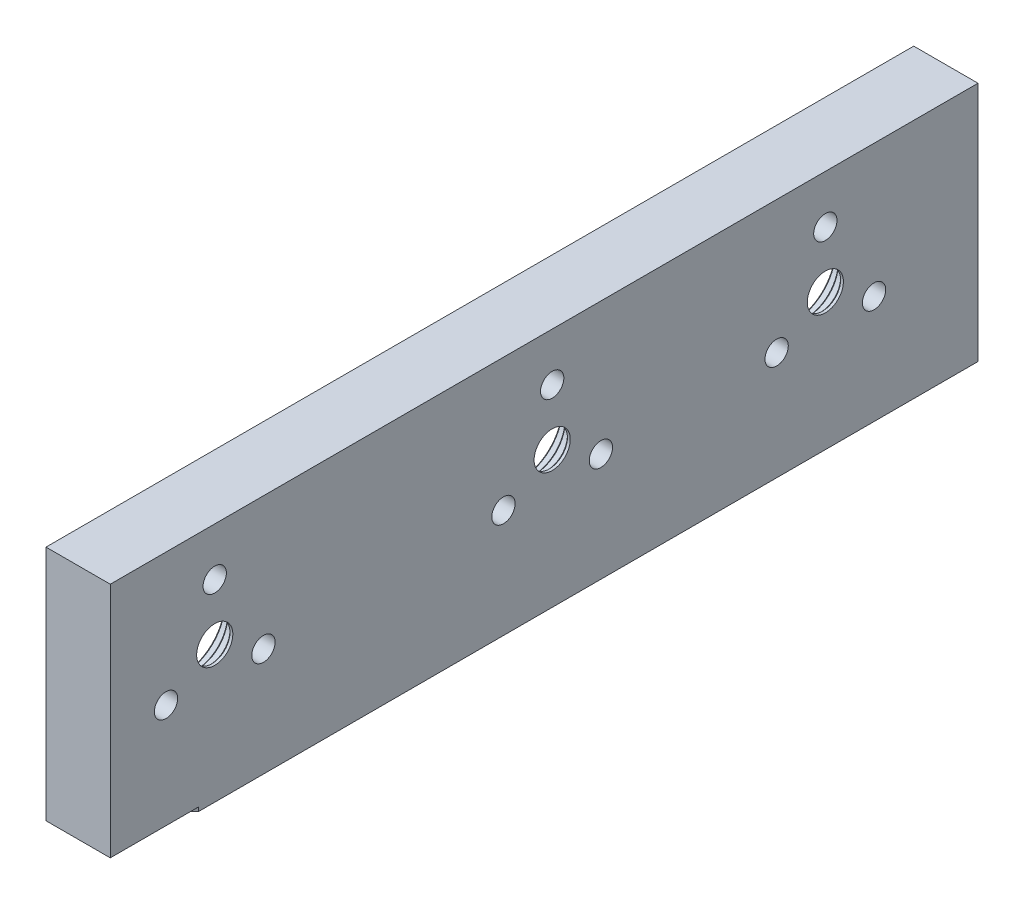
from build123d import *

# Parameters (mm, degrees)
SKETCH1_W                    = 8
SKETCH1_H                    = 108
BOSS_EXTRUDE1_DEPTH          = 30
SKETCH31_R                   = 9.5
BOSS_EXTRUDE3_DEPTH          = 1
SKETCH30_R                   = 4.1875
BOSS_EXTRUDE2_DEPTH          = 2.4666
SKETCH2_R                    = 11.25
CUT_EXTRUDE1_DEPTH           = 4
SKETCH3_R                    = 5.004
CUT_EXTRUDE2_DEPTH           = 1.6
SKETCH28_R                   = 3.75
CUT_EXTRUDE10_DEPTH          = 1.8
SKETCH29_R                   = 2.25
CUT_EXTRUDE11_DEPTH          = 64.085339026
SKETCH32_R                   = 9.5
CUT_EXTRUDE12_DEPTH          = 64.158530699
M2_5_CLEARANCE_HOLE1_D       = 2.9
LPATTERN1_COUNT              = 2
LPATTERN1_PITCH              = 34
LPATTERN1_COL_COUNT          = 2
LPATTERN1_COL_PITCH          = 42
M2_5X0_45_TAPPED_HOLE1_D     = 2.05
M2_5X0_45_TAPPED_HOLE1_DEPTH = 5
M2_5X0_45_TAPPED_HOLE1_TIP   = 0.615882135
CUT_EXTRUDE9_DEPTH           = 0.5
CHAMFER1_SIZE                = 0.25


with BuildPart() as part:
    # Sketch1 → Boss-Extrude1 (new body)
    with BuildSketch(Plane(origin=(0, 0, 0), x_dir=(1, 0, 0), z_dir=(0, 1, 0))):
        with Locations((0, -1)):
            Rectangle(SKETCH1_W, SKETCH1_H)
    extrude(amount=BOSS_EXTRUDE1_DEPTH)

    # Sketch31 → Boss-Extrude3 (add)
    with BuildSketch(Plane(origin=(4, 0, 0), x_dir=(0, 0, -1), z_dir=(1, 0, 0))):
        with Locations(Location((0, 17, 0), (0, 0, 180))):
            Circle(SKETCH31_R)
    extrude(amount=BOSS_EXTRUDE3_DEPTH)

    # Sketch30 → Boss-Extrude2 (add)
    with BuildSketch(Plane(origin=(5, 0, 0), x_dir=(0, 0, -1), z_dir=(1, 0, 0))):
        with Locations((0, 17)):
            Circle(SKETCH30_R)
    extrude(amount=BOSS_EXTRUDE2_DEPTH)

    # Sketch2 → Cut-Extrude1 (cut)
    with BuildSketch(Plane.ZY.offset(4)):
        with Locations((0, 17)):
            Circle(SKETCH2_R)
    cut_extrude1 = extrude(amount=-CUT_EXTRUDE1_DEPTH, mode=Mode.SUBTRACT)

    # Sketch3 → Cut-Extrude2 (cut)
    with BuildSketch(Plane.ZY):
        with Locations((0, 17)):
            Circle(SKETCH3_R)
    cut_extrude2 = extrude(amount=-CUT_EXTRUDE2_DEPTH, mode=Mode.SUBTRACT)

    # Sketch28 → Cut-Extrude10 (cut)
    with BuildSketch(Plane.ZY.offset(-1.6)):
        with Locations((0, 17)):
            Circle(SKETCH28_R)
    cut_extrude10 = extrude(amount=-CUT_EXTRUDE10_DEPTH, mode=Mode.SUBTRACT)

    # Sketch29 → Cut-Extrude11 (cut, through all)
    with BuildSketch(Plane.ZY.offset(-3.4)):
        with Locations((0, 17)):
            Circle(SKETCH29_R)
    cut_extrude11 = extrude(amount=-CUT_EXTRUDE11_DEPTH, mode=Mode.SUBTRACT)

    # Sketch32 → Cut-Extrude12 (cut, through all)
    with BuildSketch(Plane(origin=(4, 0, 0), x_dir=(0, 0, -1), z_dir=(1, 0, 0))):
        with Locations((0, 17)):
            Circle(SKETCH32_R)
    extrude(amount=CUT_EXTRUDE12_DEPTH, mode=Mode.SUBTRACT)

    # M2.5 Clearance Hole1 (through all)
    with Locations(Plane(origin=(4, 0, 0), x_dir=(0, 0, -1), z_dir=(1, 0, 0))):
        with Locations((0, 24), (6.062177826, 13.5), (-6.062177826, 13.5)):
            m2_5_clearance_hole1 = Hole(M2_5_CLEARANCE_HOLE1_D / 2)

    # LPattern1: Cut-Extrude1, Cut-Extrude2, Cut-Extrude10, Cut-Extrude11, M2.5 Clearance Hole1 ×2
    with Locations(*[(0, 0, -i * LPATTERN1_PITCH) for i in range(1, LPATTERN1_COUNT)]):
        add(cut_extrude1, mode=Mode.SUBTRACT)
        add(cut_extrude2, mode=Mode.SUBTRACT)
        add(cut_extrude10, mode=Mode.SUBTRACT)
        add(cut_extrude11, mode=Mode.SUBTRACT)
        add(m2_5_clearance_hole1, mode=Mode.SUBTRACT)

    # LPattern1 col: Cut-Extrude1, Cut-Extrude2, Cut-Extrude10, Cut-Extrude11, M2.5 Clearance Hole1 ×2
    with Locations(*[(0, 0, i * LPATTERN1_COL_PITCH) for i in range(1, LPATTERN1_COL_COUNT)]):
        add(cut_extrude1, mode=Mode.SUBTRACT)
        add(cut_extrude2, mode=Mode.SUBTRACT)
        add(cut_extrude10, mode=Mode.SUBTRACT)
        add(cut_extrude11, mode=Mode.SUBTRACT)
        add(m2_5_clearance_hole1, mode=Mode.SUBTRACT)

    # M2.5x0.45 Tapped Hole1
    with Locations(Plane(origin=(0, 0, 0), x_dir=(-1, 0, 0), z_dir=(0, -1, 0))):
        with Locations((0, 48), (0, 17), (0, -14), (0, -39)):
            Hole(M2_5X0_45_TAPPED_HOLE1_D / 2, depth=M2_5X0_45_TAPPED_HOLE1_DEPTH)
            with Locations((0, 0, -(M2_5X0_45_TAPPED_HOLE1_DEPTH + M2_5X0_45_TAPPED_HOLE1_TIP / 2))):  # 118° drill point
                Cone(0, M2_5X0_45_TAPPED_HOLE1_D / 2, M2_5X0_45_TAPPED_HOLE1_TIP, mode=Mode.SUBTRACT)

    # Sketch27 → Cut-Extrude9 (cut)
    with BuildSketch(Plane.XZ):
        Polygon((4, 44), (4, 55), (-4, 55), (-4, 52), align=None)
    extrude(amount=-CUT_EXTRUDE9_DEPTH, mode=Mode.SUBTRACT)

    # Chamfer1
    chamfer1_edges = [part.edges().sort_by_distance(p)[0] for p in [
        (-4, 17, -11.25),
        (0, 17, -5.004),
        (1.6, 17, -3.75),
        (3.4, 17, -2.25),
        (-4, 17, 30.75),
        (-4, 17, -45.25),
        (0, 17, 36.996),
        (0, 17, -39.004),
        (1.6, 17, 38.25),
        (1.6, 17, -37.75),
        (3.4, 17, 39.75),
        (3.4, 17, -36.25),
    ]]
    chamfer(chamfer1_edges, length=CHAMFER1_SIZE)


solid = part.part
